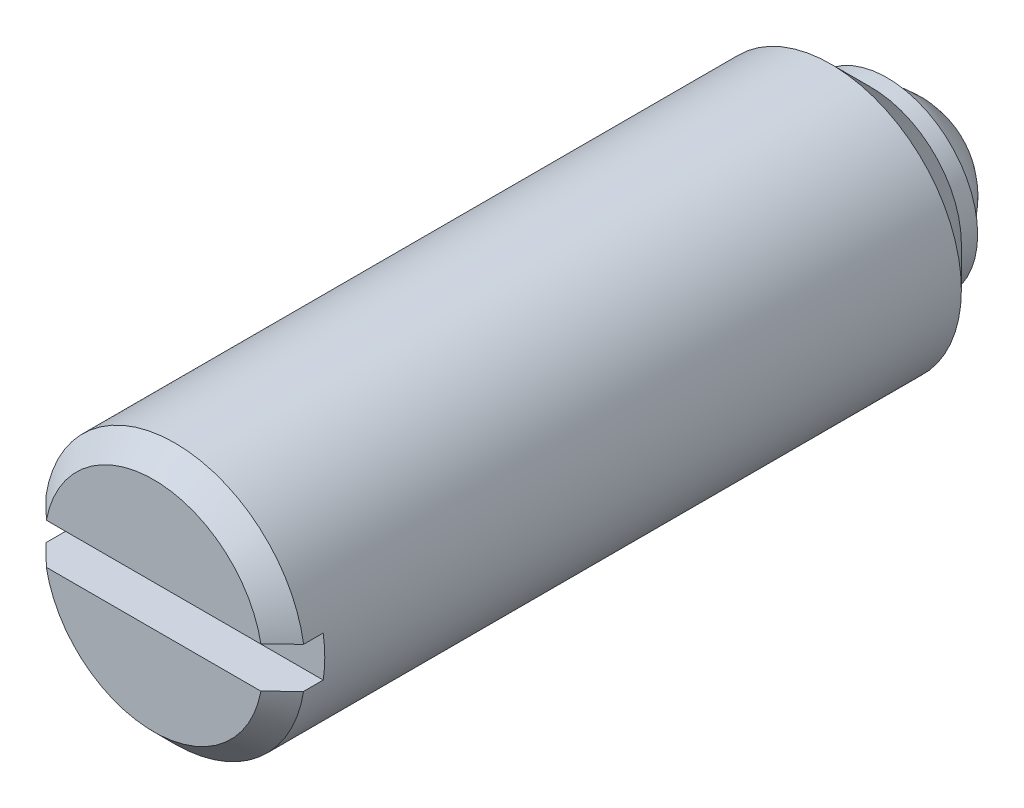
ISO-10303-21;
HEADER;
FILE_DESCRIPTION(('STEP AP214'),'2;1');
FILE_NAME('part.step','',(''),(''),'','','');
FILE_SCHEMA(('AUTOMOTIVE_DESIGN { 1 0 10303 214 1 1 1 1 }'));
ENDSEC;
DATA;
#1=APPLICATION_CONTEXT('core data for automotive mechanical design processes');
#2=APPLICATION_PROTOCOL_DEFINITION('international standard','automotive_design',2000,#1);
#3=PRODUCT_CONTEXT('',#1,'mechanical');
#4=PRODUCT('Part','Part','',(#3));
#5=PRODUCT_RELATED_PRODUCT_CATEGORY('part','',(#4));
#6=PRODUCT_DEFINITION_FORMATION('','',#4);
#7=PRODUCT_DEFINITION_CONTEXT('part definition',#1,'design');
#8=PRODUCT_DEFINITION('design','',#6,#7);
#9=PRODUCT_DEFINITION_SHAPE('','',#8);
#10=(LENGTH_UNIT() NAMED_UNIT(*) SI_UNIT(.MILLI.,.METRE.));
#11=(NAMED_UNIT(*) PLANE_ANGLE_UNIT() SI_UNIT($,.RADIAN.));
#12=(NAMED_UNIT(*) SI_UNIT($,.STERADIAN.) SOLID_ANGLE_UNIT());
#13=UNCERTAINTY_MEASURE_WITH_UNIT(LENGTH_MEASURE(1.E-05),#10,'distance_accuracy_value','');
#14=(GEOMETRIC_REPRESENTATION_CONTEXT(3) GLOBAL_UNCERTAINTY_ASSIGNED_CONTEXT((#13)) GLOBAL_UNIT_ASSIGNED_CONTEXT((#10,
#11,#12)) REPRESENTATION_CONTEXT('',''));
#15=CARTESIAN_POINT('',(0.,0.,0.));
#16=DIRECTION('',(0.,0.,1.));
#17=DIRECTION('',(1.,0.,0.));
#18=AXIS2_PLACEMENT_3D('',#15,#16,#17);
#19=CARTESIAN_POINT('',(0.,0.,3.5));
#20=DIRECTION('',(0.,0.,-1.));
#21=DIRECTION('',(-1.,0.,0.));
#22=AXIS2_PLACEMENT_3D('',#19,#20,#21);
#23=PLANE('',#22);
#24=CARTESIAN_POINT('',(0.,0.,3.5));
#25=DIRECTION('',(0.,0.,-1.));
#26=DIRECTION('',(-1.,0.,0.));
#27=AXIS2_PLACEMENT_3D('',#24,#25,#26);
#28=CIRCLE('',#27,4.76969600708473);
#29=CARTESIAN_POINT('',(-4.76969600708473,0.,3.5));
#30=VERTEX_POINT('',#29);
#31=EDGE_CURVE('E151',#30,#30,#28,.T.);
#32=ORIENTED_EDGE('',*,*,#31,.F.);
#33=EDGE_LOOP('',(#32));
#34=FACE_BOUND('',#33,.T.);
#35=CARTESIAN_POINT('',(0.,0.,3.5));
#36=DIRECTION('',(0.,0.,1.));
#37=DIRECTION('',(1.,0.,0.));
#38=AXIS2_PLACEMENT_3D('',#35,#36,#37);
#39=CIRCLE('',#38,5.55);
#40=CARTESIAN_POINT('',(5.55,0.,3.5));
#41=VERTEX_POINT('',#40);
#42=EDGE_CURVE('E158',#41,#41,#39,.T.);
#43=ORIENTED_EDGE('',*,*,#42,.F.);
#44=EDGE_LOOP('',(#43));
#45=FACE_BOUND('',#44,.T.);
#46=ADVANCED_FACE('F14',(#34,#45),#23,.T.);
#47=CARTESIAN_POINT('',(0.,0.,5.));
#48=DIRECTION('',(0.,0.,-1.));
#49=DIRECTION('',(1.,0.,0.));
#50=AXIS2_PLACEMENT_3D('',#47,#48,#49);
#51=SPHERICAL_SURFACE('',#50,5.);
#52=ORIENTED_EDGE('',*,*,#31,.T.);
#53=EDGE_LOOP('',(#52));
#54=FACE_BOUND('',#53,.T.);
#55=ADVANCED_FACE('F178',(#54),#51,.T.);
#56=CARTESIAN_POINT('',(0.,0.,53.2601976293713));
#57=DIRECTION('',(0.,0.,1.));
#58=DIRECTION('',(1.,0.,0.));
#59=AXIS2_PLACEMENT_3D('',#56,#57,#58);
#60=CYLINDRICAL_SURFACE('',#59,5.55);
#61=ORIENTED_EDGE('',*,*,#42,.T.);
#62=EDGE_LOOP('',(#61));
#63=FACE_BOUND('',#62,.T.);
#64=CARTESIAN_POINT('',(0.,0.,4.5));
#65=DIRECTION('',(0.,0.,1.));
#66=DIRECTION('',(1.,0.,0.));
#67=AXIS2_PLACEMENT_3D('',#64,#65,#66);
#68=CIRCLE('',#67,5.55);
#69=CARTESIAN_POINT('',(5.55,0.,4.5));
#70=VERTEX_POINT('',#69);
#71=EDGE_CURVE('E161',#70,#70,#68,.T.);
#72=ORIENTED_EDGE('',*,*,#71,.F.);
#73=EDGE_LOOP('',(#72));
#74=FACE_BOUND('',#73,.T.);
#75=ADVANCED_FACE('F170',(#63,#74),#60,.T.);
#76=CARTESIAN_POINT('',(0.,0.,6.95));
#77=DIRECTION('',(0.,0.,1.));
#78=DIRECTION('',(1.,0.,0.));
#79=AXIS2_PLACEMENT_3D('',#76,#77,#78);
#80=CONICAL_SURFACE('',#79,8.,0.785398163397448);
#81=ORIENTED_EDGE('',*,*,#71,.T.);
#82=EDGE_LOOP('',(#81));
#83=FACE_BOUND('',#82,.T.);
#84=CARTESIAN_POINT('',(0.,0.,6.95));
#85=DIRECTION('',(0.,0.,1.));
#86=DIRECTION('',(1.,0.,0.));
#87=AXIS2_PLACEMENT_3D('',#84,#85,#86);
#88=CIRCLE('',#87,8.);
#89=CARTESIAN_POINT('',(8.,0.,6.95));
#90=VERTEX_POINT('',#89);
#91=EDGE_CURVE('E164',#90,#90,#88,.T.);
#92=ORIENTED_EDGE('',*,*,#91,.F.);
#93=EDGE_LOOP('',(#92));
#94=FACE_BOUND('',#93,.T.);
#95=ADVANCED_FACE('F168',(#83,#94),#80,.T.);
#96=CARTESIAN_POINT('',(0.,8.,48.5));
#97=DIRECTION('',(0.,0.,1.));
#98=DIRECTION('',(1.,0.,0.));
#99=AXIS2_PLACEMENT_3D('',#96,#97,#98);
#100=PLANE('',#99);
#101=DIRECTION('',(1.,0.,0.));
#102=VECTOR('',#101,1.);
#103=CARTESIAN_POINT('',(-7.90174031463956,-1.25,48.5));
#104=LINE('',#103,#102);
#105=CARTESIAN_POINT('',(-6.58236279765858,-1.25,48.5));
#106=VERTEX_POINT('',#105);
#107=CARTESIAN_POINT('',(6.58236279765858,-1.25,48.5));
#108=VERTEX_POINT('',#107);
#109=EDGE_CURVE('E148',#106,#108,#104,.T.);
#110=ORIENTED_EDGE('',*,*,#109,.F.);
#111=CARTESIAN_POINT('',(0.,0.,48.5));
#112=DIRECTION('',(0.,0.,1.));
#113=DIRECTION('',(1.,0.,0.));
#114=AXIS2_PLACEMENT_3D('',#111,#112,#113);
#115=CIRCLE('',#114,6.7);
#116=EDGE_CURVE('E142',#106,#108,#115,.T.);
#117=ORIENTED_EDGE('',*,*,#116,.T.);
#118=EDGE_LOOP('',(#110,#117));
#119=FACE_BOUND('',#118,.T.);
#120=ADVANCED_FACE('F124',(#119),#100,.T.);
#121=CARTESIAN_POINT('',(-7.90174031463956,-1.25,46.));
#122=DIRECTION('',(0.,-1.,0.));
#123=DIRECTION('',(1.,0.,0.));
#124=AXIS2_PLACEMENT_3D('',#121,#122,#123);
#125=PLANE('',#124);
#126=DIRECTION('',(0.,0.,1.));
#127=VECTOR('',#126,1.);
#128=CARTESIAN_POINT('',(-7.90174031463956,-1.25,46.));
#129=LINE('',#128,#127);
#130=CARTESIAN_POINT('',(-7.90174031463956,-1.25,46.));
#131=VERTEX_POINT('',#130);
#132=CARTESIAN_POINT('',(-7.90174031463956,-1.25,47.2));
#133=VERTEX_POINT('',#132);
#134=EDGE_CURVE('E81',#131,#133,#129,.T.);
#135=ORIENTED_EDGE('',*,*,#134,.T.);
#136=CARTESIAN_POINT('',(-7.90174031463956,-1.25,47.2));
#137=CARTESIAN_POINT('',(-7.68210487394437,-1.25,47.4169310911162));
#138=CARTESIAN_POINT('',(-7.46236593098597,-1.25,47.6337575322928));
#139=CARTESIAN_POINT('',(-7.13254175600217,-1.25,47.9587781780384));
#140=CARTESIAN_POINT('',(-7.02256440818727,-1.25,48.0670818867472));
#141=CARTESIAN_POINT('',(-6.80252765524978,-1.25,48.2836060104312));
#142=CARTESIAN_POINT('',(-6.6924682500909,-1.25,48.3918264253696));
#143=CARTESIAN_POINT('',(-6.58236279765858,-1.25,48.5));
#144=B_SPLINE_CURVE_WITH_KNOTS('',3,(#136,#137,#138,#139,#140,#141,#142,#143),.UNSPECIFIED.,.F.,
.F.,(4,2,2,4),(0.,0.92611531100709,1.38917293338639,1.85223076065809),.UNSPECIFIED.);
#145=EDGE_CURVE('E110',#133,#106,#144,.T.);
#146=ORIENTED_EDGE('',*,*,#145,.T.);
#147=ORIENTED_EDGE('',*,*,#109,.T.);
#148=CARTESIAN_POINT('',(6.58236279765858,-1.25,48.5));
#149=CARTESIAN_POINT('',(6.6924682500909,-1.25,48.3918264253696));
#150=CARTESIAN_POINT('',(6.80252765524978,-1.25,48.2836060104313));
#151=CARTESIAN_POINT('',(7.02256440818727,-1.25,48.0670818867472));
#152=CARTESIAN_POINT('',(7.13254175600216,-1.25,47.9587781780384));
#153=CARTESIAN_POINT('',(7.46236593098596,-1.25,47.6337575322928));
#154=CARTESIAN_POINT('',(7.68210487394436,-1.25,47.4169310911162));
#155=CARTESIAN_POINT('',(7.90174031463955,-1.25,47.2));
#156=B_SPLINE_CURVE_WITH_KNOTS('',3,(#148,#149,#150,#151,#152,#153,#154,#155),.UNSPECIFIED.,.F.,
.F.,(4,2,2,4),(0.,0.46305782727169,0.926115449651,1.85223076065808),.UNSPECIFIED.);
#157=CARTESIAN_POINT('',(7.90174031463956,-1.25,47.2));
#158=VERTEX_POINT('',#157);
#159=EDGE_CURVE('E103',#108,#158,#156,.T.);
#160=ORIENTED_EDGE('',*,*,#159,.T.);
#161=DIRECTION('',(0.,0.,1.));
#162=VECTOR('',#161,1.);
#163=CARTESIAN_POINT('',(7.90174031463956,-1.25,46.));
#164=LINE('',#163,#162);
#165=CARTESIAN_POINT('',(7.90174031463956,-1.25,46.));
#166=VERTEX_POINT('',#165);
#167=EDGE_CURVE('E83',#166,#158,#164,.T.);
#168=ORIENTED_EDGE('',*,*,#167,.F.);
#169=DIRECTION('',(1.,0.,0.));
#170=VECTOR('',#169,1.);
#171=CARTESIAN_POINT('',(-7.90174031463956,-1.25,46.));
#172=LINE('',#171,#170);
#173=EDGE_CURVE('E68',#131,#166,#172,.T.);
#174=ORIENTED_EDGE('',*,*,#173,.F.);
#175=EDGE_LOOP('',(#135,#146,#147,#160,#168,#174));
#176=FACE_BOUND('',#175,.T.);
#177=ADVANCED_FACE('F80',(#176),#125,.F.);
#178=DIRECTION('',(1.,0.,0.));
#179=VECTOR('',#178,1.);
#180=CARTESIAN_POINT('',(-7.90174031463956,1.25,48.5));
#181=LINE('',#180,#179);
#182=CARTESIAN_POINT('',(-6.58236279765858,1.25,48.5));
#183=VERTEX_POINT('',#182);
#184=CARTESIAN_POINT('',(6.58236279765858,1.25,48.5));
#185=VERTEX_POINT('',#184);
#186=EDGE_CURVE('E75',#183,#185,#181,.T.);
#187=ORIENTED_EDGE('',*,*,#186,.T.);
#188=CARTESIAN_POINT('',(0.,0.,48.5));
#189=DIRECTION('',(0.,0.,1.));
#190=DIRECTION('',(1.,0.,0.));
#191=AXIS2_PLACEMENT_3D('',#188,#189,#190);
#192=CIRCLE('',#191,6.7);
#193=EDGE_CURVE('E9',#185,#183,#192,.T.);
#194=ORIENTED_EDGE('',*,*,#193,.T.);
#195=EDGE_LOOP('',(#187,#194));
#196=FACE_BOUND('',#195,.T.);
#197=ADVANCED_FACE('F123',(#196),#100,.T.);
#198=CARTESIAN_POINT('',(-7.90174031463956,1.25,46.));
#199=DIRECTION('',(0.,-1.,0.));
#200=DIRECTION('',(1.,0.,0.));
#201=AXIS2_PLACEMENT_3D('',#198,#199,#200);
#202=PLANE('',#201);
#203=DIRECTION('',(0.,0.,1.));
#204=VECTOR('',#203,1.);
#205=CARTESIAN_POINT('',(7.90174031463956,1.25,46.));
#206=LINE('',#205,#204);
#207=CARTESIAN_POINT('',(7.90174031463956,1.25,46.));
#208=VERTEX_POINT('',#207);
#209=CARTESIAN_POINT('',(7.90174031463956,1.25,47.2));
#210=VERTEX_POINT('',#209);
#211=EDGE_CURVE('E92',#208,#210,#206,.T.);
#212=ORIENTED_EDGE('',*,*,#211,.T.);
#213=CARTESIAN_POINT('',(7.90174031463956,1.25,47.2));
#214=CARTESIAN_POINT('',(7.68210487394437,1.25,47.4169310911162));
#215=CARTESIAN_POINT('',(7.46236593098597,1.25,47.6337575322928));
#216=CARTESIAN_POINT('',(7.13254175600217,1.25,47.9587781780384));
#217=CARTESIAN_POINT('',(7.02256440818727,1.25,48.0670818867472));
#218=CARTESIAN_POINT('',(6.80252765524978,1.25,48.2836060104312));
#219=CARTESIAN_POINT('',(6.6924682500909,1.25,48.3918264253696));
#220=CARTESIAN_POINT('',(6.58236279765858,1.25,48.5));
#221=B_SPLINE_CURVE_WITH_KNOTS('',3,(#213,#214,#215,#216,#217,#218,#219,#220),.UNSPECIFIED.,.F.,
.F.,(4,2,2,4),(0.,0.92611531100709,1.38917293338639,1.85223076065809),.UNSPECIFIED.);
#222=EDGE_CURVE('E23',#210,#185,#221,.T.);
#223=ORIENTED_EDGE('',*,*,#222,.T.);
#224=ORIENTED_EDGE('',*,*,#186,.F.);
#225=CARTESIAN_POINT('',(-6.58236279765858,1.25,48.5));
#226=CARTESIAN_POINT('',(-6.6924682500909,1.25,48.3918264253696));
#227=CARTESIAN_POINT('',(-6.80252765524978,1.25,48.2836060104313));
#228=CARTESIAN_POINT('',(-7.02256440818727,1.25,48.0670818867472));
#229=CARTESIAN_POINT('',(-7.13254175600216,1.25,47.9587781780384));
#230=CARTESIAN_POINT('',(-7.46236593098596,1.25,47.6337575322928));
#231=CARTESIAN_POINT('',(-7.68210487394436,1.25,47.4169310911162));
#232=CARTESIAN_POINT('',(-7.90174031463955,1.25,47.2));
#233=B_SPLINE_CURVE_WITH_KNOTS('',3,(#225,#226,#227,#228,#229,#230,#231,#232),.UNSPECIFIED.,.F.,
.F.,(4,2,2,4),(0.,0.46305782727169,0.926115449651,1.85223076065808),.UNSPECIFIED.);
#234=CARTESIAN_POINT('',(-7.90174031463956,1.25,47.2));
#235=VERTEX_POINT('',#234);
#236=EDGE_CURVE('E133',#183,#235,#233,.T.);
#237=ORIENTED_EDGE('',*,*,#236,.T.);
#238=DIRECTION('',(0.,0.,1.));
#239=VECTOR('',#238,1.);
#240=CARTESIAN_POINT('',(-7.90174031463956,1.25,46.));
#241=LINE('',#240,#239);
#242=CARTESIAN_POINT('',(-7.90174031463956,1.25,46.));
#243=VERTEX_POINT('',#242);
#244=EDGE_CURVE('E97',#243,#235,#241,.T.);
#245=ORIENTED_EDGE('',*,*,#244,.F.);
#246=DIRECTION('',(1.,0.,0.));
#247=VECTOR('',#246,1.);
#248=CARTESIAN_POINT('',(-7.90174031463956,1.25,46.));
#249=LINE('',#248,#247);
#250=EDGE_CURVE('E71',#243,#208,#249,.T.);
#251=ORIENTED_EDGE('',*,*,#250,.T.);
#252=EDGE_LOOP('',(#212,#223,#224,#237,#245,#251));
#253=FACE_BOUND('',#252,.T.);
#254=ADVANCED_FACE('F126',(#253),#202,.T.);
#255=CARTESIAN_POINT('',(0.,0.,46.));
#256=DIRECTION('',(0.,0.,1.));
#257=DIRECTION('',(1.,0.,0.));
#258=AXIS2_PLACEMENT_3D('',#255,#256,#257);
#259=PLANE('',#258);
#260=CARTESIAN_POINT('',(0.,0.,46.));
#261=DIRECTION('',(0.,0.,1.));
#262=DIRECTION('',(1.,0.,0.));
#263=AXIS2_PLACEMENT_3D('',#260,#261,#262);
#264=CIRCLE('',#263,8.);
#265=EDGE_CURVE('E65',#243,#131,#264,.T.);
#266=ORIENTED_EDGE('',*,*,#265,.T.);
#267=ORIENTED_EDGE('',*,*,#173,.T.);
#268=EDGE_CURVE('E77',#166,#208,#264,.T.);
#269=ORIENTED_EDGE('',*,*,#268,.T.);
#270=ORIENTED_EDGE('',*,*,#250,.F.);
#271=EDGE_LOOP('',(#266,#267,#269,#270));
#272=FACE_BOUND('',#271,.T.);
#273=ADVANCED_FACE('F67',(#272),#259,.T.);
#274=CARTESIAN_POINT('',(0.,0.,18.5));
#275=DIRECTION('',(0.,0.,-1.));
#276=DIRECTION('',(-1.,0.,0.));
#277=AXIS2_PLACEMENT_3D('',#274,#275,#276);
#278=CYLINDRICAL_SURFACE('',#277,8.);
#279=ORIENTED_EDGE('',*,*,#167,.T.);
#280=CARTESIAN_POINT('',(0.,0.,47.2));
#281=DIRECTION('',(0.,0.,1.));
#282=DIRECTION('',(1.,0.,0.));
#283=AXIS2_PLACEMENT_3D('',#280,#281,#282);
#284=CIRCLE('',#283,8.);
#285=EDGE_CURVE('E90',#158,#133,#284,.F.);
#286=ORIENTED_EDGE('',*,*,#285,.T.);
#287=ORIENTED_EDGE('',*,*,#134,.F.);
#288=ORIENTED_EDGE('',*,*,#265,.F.);
#289=ORIENTED_EDGE('',*,*,#244,.T.);
#290=CARTESIAN_POINT('',(0.,0.,47.2));
#291=DIRECTION('',(0.,0.,1.));
#292=DIRECTION('',(1.,0.,0.));
#293=AXIS2_PLACEMENT_3D('',#290,#291,#292);
#294=CIRCLE('',#293,8.);
#295=EDGE_CURVE('E99',#235,#210,#294,.F.);
#296=ORIENTED_EDGE('',*,*,#295,.T.);
#297=ORIENTED_EDGE('',*,*,#211,.F.);
#298=ORIENTED_EDGE('',*,*,#268,.F.);
#299=EDGE_LOOP('',(#279,#286,#287,#288,#289,#296,#297,#298));
#300=FACE_BOUND('',#299,.T.);
#301=ORIENTED_EDGE('',*,*,#91,.T.);
#302=EDGE_LOOP('',(#301));
#303=FACE_BOUND('',#302,.T.);
#304=ADVANCED_FACE('F87',(#300,#303),#278,.T.);
#305=CARTESIAN_POINT('',(0.,0.,47.2));
#306=DIRECTION('',(0.,0.,-1.));
#307=DIRECTION('',(-1.,0.,0.));
#308=AXIS2_PLACEMENT_3D('',#305,#306,#307);
#309=CONICAL_SURFACE('',#308,8.,0.785398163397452);
#310=ORIENTED_EDGE('',*,*,#159,.F.);
#311=ORIENTED_EDGE('',*,*,#116,.F.);
#312=ORIENTED_EDGE('',*,*,#145,.F.);
#313=ORIENTED_EDGE('',*,*,#285,.F.);
#314=EDGE_LOOP('',(#310,#311,#312,#313));
#315=FACE_BOUND('',#314,.T.);
#316=ADVANCED_FACE('F116',(#315),#309,.T.);
#317=CARTESIAN_POINT('',(0.,0.,47.2));
#318=DIRECTION('',(0.,0.,-1.));
#319=DIRECTION('',(-1.,0.,0.));
#320=AXIS2_PLACEMENT_3D('',#317,#318,#319);
#321=CONICAL_SURFACE('',#320,8.,0.785398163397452);
#322=ORIENTED_EDGE('',*,*,#236,.F.);
#323=ORIENTED_EDGE('',*,*,#193,.F.);
#324=ORIENTED_EDGE('',*,*,#222,.F.);
#325=ORIENTED_EDGE('',*,*,#295,.F.);
#326=EDGE_LOOP('',(#322,#323,#324,#325));
#327=FACE_BOUND('',#326,.T.);
#328=ADVANCED_FACE('F16',(#327),#321,.T.);
#329=CLOSED_SHELL('',(#46,#55,#75,#95,#120,#177,#197,#254,#273,#304,#316,#328));
#330=MANIFOLD_SOLID_BREP('B1',#329);
#331=ADVANCED_BREP_SHAPE_REPRESENTATION('',(#18,#330),#14);
#332=SHAPE_DEFINITION_REPRESENTATION(#9,#331);
ENDSEC;
END-ISO-10303-21;
